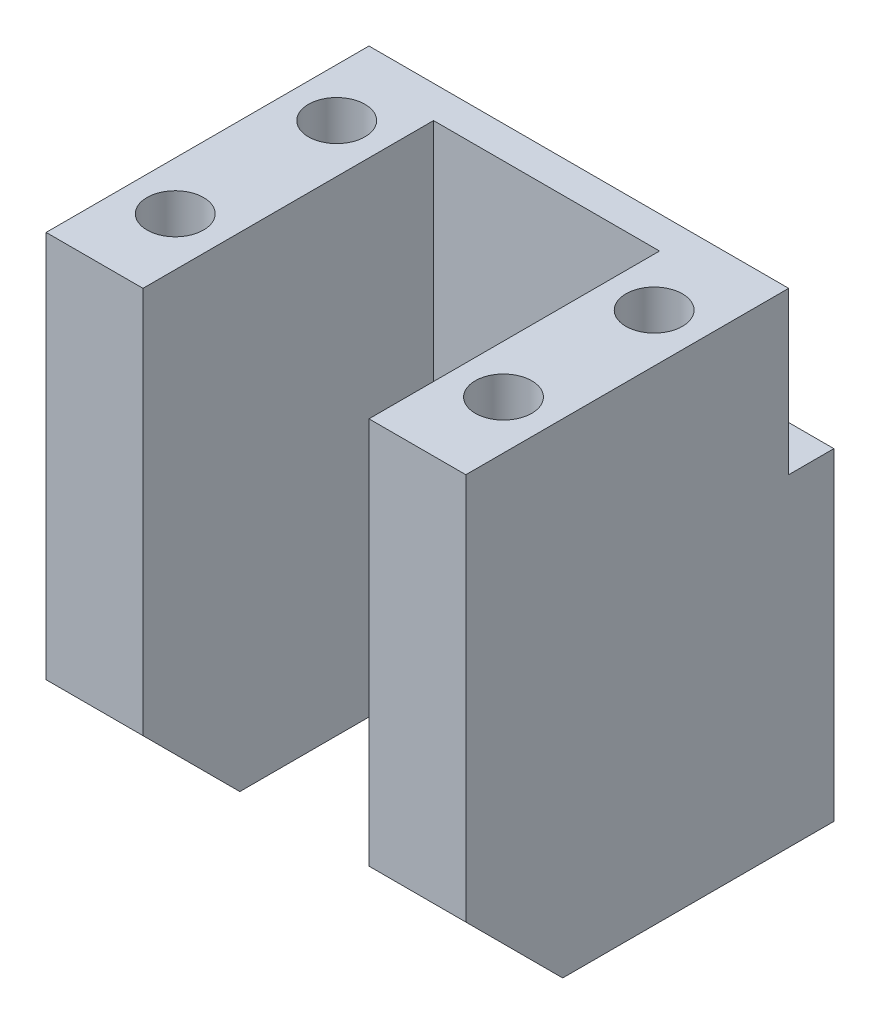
ISO-10303-21;
HEADER;
FILE_DESCRIPTION(('STEP AP214'),'2;1');
FILE_NAME('part.step','',(''),(''),'','','');
FILE_SCHEMA(('AUTOMOTIVE_DESIGN { 1 0 10303 214 1 1 1 1 }'));
ENDSEC;
DATA;
#1=APPLICATION_CONTEXT('core data for automotive mechanical design processes');
#2=APPLICATION_PROTOCOL_DEFINITION('international standard','automotive_design',2000,#1);
#3=PRODUCT_CONTEXT('',#1,'mechanical');
#4=PRODUCT('Part','Part','',(#3));
#5=PRODUCT_RELATED_PRODUCT_CATEGORY('part','',(#4));
#6=PRODUCT_DEFINITION_FORMATION('','',#4);
#7=PRODUCT_DEFINITION_CONTEXT('part definition',#1,'design');
#8=PRODUCT_DEFINITION('design','',#6,#7);
#9=PRODUCT_DEFINITION_SHAPE('','',#8);
#10=(LENGTH_UNIT() NAMED_UNIT(*) SI_UNIT(.MILLI.,.METRE.));
#11=(NAMED_UNIT(*) PLANE_ANGLE_UNIT() SI_UNIT($,.RADIAN.));
#12=(NAMED_UNIT(*) SI_UNIT($,.STERADIAN.) SOLID_ANGLE_UNIT());
#13=UNCERTAINTY_MEASURE_WITH_UNIT(LENGTH_MEASURE(1.E-05),#10,'distance_accuracy_value','');
#14=(GEOMETRIC_REPRESENTATION_CONTEXT(3) GLOBAL_UNCERTAINTY_ASSIGNED_CONTEXT((#13)) GLOBAL_UNIT_ASSIGNED_CONTEXT((#10,
#11,#12)) REPRESENTATION_CONTEXT('',''));
#15=CARTESIAN_POINT('',(0.,0.,0.));
#16=DIRECTION('',(0.,0.,1.));
#17=DIRECTION('',(1.,0.,0.));
#18=AXIS2_PLACEMENT_3D('',#15,#16,#17);
#19=CARTESIAN_POINT('',(26.,20.,-22.8));
#20=DIRECTION('',(0.,-1.,0.));
#21=DIRECTION('',(0.,0.,-1.));
#22=AXIS2_PLACEMENT_3D('',#19,#20,#21);
#23=PLANE('',#22);
#24=DIRECTION('',(0.707106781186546,0.,-0.707106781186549));
#25=VECTOR('',#24,1.);
#26=CARTESIAN_POINT('',(-8.09999999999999,20.,-8.09999999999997));
#27=LINE('',#26,#25);
#28=CARTESIAN_POINT('',(3.8,20.,-20.));
#29=VERTEX_POINT('',#28);
#30=CARTESIAN_POINT('',(5.74644660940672,20.,-21.9464466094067));
#31=VERTEX_POINT('',#30);
#32=EDGE_CURVE('E179',#29,#31,#27,.T.);
#33=ORIENTED_EDGE('',*,*,#32,.T.);
#34=CARTESIAN_POINT('',(5.39289321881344,20.,-22.3));
#35=DIRECTION('',(0.,-1.,0.));
#36=DIRECTION('',(0.,0.,-1.));
#37=AXIS2_PLACEMENT_3D('',#34,#35,#36);
#38=CIRCLE('',#37,0.5);
#39=CARTESIAN_POINT('',(5.39289321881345,20.,-22.8));
#40=VERTEX_POINT('',#39);
#41=EDGE_CURVE('E235',#31,#40,#38,.F.);
#42=ORIENTED_EDGE('',*,*,#41,.T.);
#43=DIRECTION('',(1.,0.,0.));
#44=VECTOR('',#43,1.);
#45=CARTESIAN_POINT('',(26.,20.,-22.8));
#46=LINE('',#45,#44);
#47=CARTESIAN_POINT('',(0.,20.,-22.8));
#48=VERTEX_POINT('',#47);
#49=EDGE_CURVE('E216',#48,#40,#46,.T.);
#50=ORIENTED_EDGE('',*,*,#49,.F.);
#51=DIRECTION('',(0.,0.,1.));
#52=VECTOR('',#51,1.);
#53=CARTESIAN_POINT('',(0.,20.,-22.8));
#54=LINE('',#53,#52);
#55=CARTESIAN_POINT('',(0.,20.,-20.));
#56=VERTEX_POINT('',#55);
#57=EDGE_CURVE('E255',#48,#56,#54,.T.);
#58=ORIENTED_EDGE('',*,*,#57,.T.);
#59=DIRECTION('',(1.,0.,0.));
#60=VECTOR('',#59,1.);
#61=CARTESIAN_POINT('',(26.,20.,-20.));
#62=LINE('',#61,#60);
#63=EDGE_CURVE('E209',#56,#29,#62,.T.);
#64=ORIENTED_EDGE('',*,*,#63,.T.);
#65=EDGE_LOOP('',(#33,#42,#50,#58,#64));
#66=FACE_BOUND('',#65,.T.);
#67=ADVANCED_FACE('F35',(#66),#23,.F.);
#68=CARTESIAN_POINT('',(0.,0.,-22.8));
#69=DIRECTION('',(0.,0.,1.));
#70=DIRECTION('',(1.,0.,0.));
#71=AXIS2_PLACEMENT_3D('',#68,#69,#70);
#72=PLANE('',#71);
#73=ORIENTED_EDGE('',*,*,#49,.T.);
#74=DIRECTION('',(0.,1.,0.));
#75=VECTOR('',#74,1.);
#76=CARTESIAN_POINT('',(5.39289321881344,0.,-22.8));
#77=LINE('',#76,#75);
#78=CARTESIAN_POINT('',(5.39289321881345,0.,-22.8));
#79=VERTEX_POINT('',#78);
#80=EDGE_CURVE('E238',#40,#79,#77,.F.);
#81=ORIENTED_EDGE('',*,*,#80,.T.);
#82=DIRECTION('',(-1.,0.,0.));
#83=VECTOR('',#82,1.);
#84=CARTESIAN_POINT('',(26.,0.,-22.8));
#85=LINE('',#84,#83);
#86=CARTESIAN_POINT('',(0.,0.,-22.8));
#87=VERTEX_POINT('',#86);
#88=EDGE_CURVE('E208',#79,#87,#85,.T.);
#89=ORIENTED_EDGE('',*,*,#88,.T.);
#90=DIRECTION('',(0.,1.,0.));
#91=VECTOR('',#90,1.);
#92=CARTESIAN_POINT('',(0.,0.,-22.8));
#93=LINE('',#92,#91);
#94=EDGE_CURVE('E213',#87,#48,#93,.T.);
#95=ORIENTED_EDGE('',*,*,#94,.T.);
#96=EDGE_LOOP('',(#73,#81,#89,#95));
#97=FACE_BOUND('',#96,.T.);
#98=ADVANCED_FACE('F417',(#97),#72,.F.);
#99=CARTESIAN_POINT('',(0.,30.,0.));
#100=DIRECTION('',(0.,0.,-1.));
#101=DIRECTION('',(-1.,0.,0.));
#102=AXIS2_PLACEMENT_3D('',#99,#100,#101);
#103=PLANE('',#102);
#104=DIRECTION('',(1.,0.,0.));
#105=VECTOR('',#104,1.);
#106=CARTESIAN_POINT('',(0.,6.00000000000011,0.));
#107=LINE('',#106,#105);
#108=CARTESIAN_POINT('',(0.,6.0000000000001,0.));
#109=VERTEX_POINT('',#108);
#110=CARTESIAN_POINT('',(6.,6.00000000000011,0.));
#111=VERTEX_POINT('',#110);
#112=EDGE_CURVE('E287',#109,#111,#107,.T.);
#113=ORIENTED_EDGE('',*,*,#112,.T.);
#114=DIRECTION('',(0.,1.,0.));
#115=VECTOR('',#114,1.);
#116=CARTESIAN_POINT('',(6.,0.,0.));
#117=LINE('',#116,#115);
#118=CARTESIAN_POINT('',(6.,30.,0.));
#119=VERTEX_POINT('',#118);
#120=EDGE_CURVE('E222',#111,#119,#117,.T.);
#121=ORIENTED_EDGE('',*,*,#120,.T.);
#122=DIRECTION('',(1.,0.,0.));
#123=VECTOR('',#122,1.);
#124=CARTESIAN_POINT('',(0.,30.,0.));
#125=LINE('',#124,#123);
#126=CARTESIAN_POINT('',(0.,30.,0.));
#127=VERTEX_POINT('',#126);
#128=EDGE_CURVE('E323',#127,#119,#125,.T.);
#129=ORIENTED_EDGE('',*,*,#128,.F.);
#130=DIRECTION('',(0.,-1.,0.));
#131=VECTOR('',#130,1.);
#132=CARTESIAN_POINT('',(0.,30.,0.));
#133=LINE('',#132,#131);
#134=EDGE_CURVE('E278',#127,#109,#133,.T.);
#135=ORIENTED_EDGE('',*,*,#134,.T.);
#136=EDGE_LOOP('',(#113,#121,#129,#135));
#137=FACE_BOUND('',#136,.T.);
#138=ADVANCED_FACE('F320',(#137),#103,.F.);
#139=CARTESIAN_POINT('',(0.,6.00000000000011,0.));
#140=DIRECTION('',(0.,0.707106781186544,-0.707106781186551));
#141=DIRECTION('',(1.,0.,0.));
#142=AXIS2_PLACEMENT_3D('',#139,#140,#141);
#143=PLANE('',#142);
#144=DIRECTION('',(0.,0.707106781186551,0.707106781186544));
#145=VECTOR('',#144,1.);
#146=CARTESIAN_POINT('',(6.,6.00000000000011,0.));
#147=LINE('',#146,#145);
#148=CARTESIAN_POINT('',(6.,0.,-6.00000000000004));
#149=VERTEX_POINT('',#148);
#150=EDGE_CURVE('E304',#111,#149,#147,.F.);
#151=ORIENTED_EDGE('',*,*,#150,.F.);
#152=ORIENTED_EDGE('',*,*,#112,.F.);
#153=DIRECTION('',(0.,-0.707106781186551,-0.707106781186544));
#154=VECTOR('',#153,1.);
#155=CARTESIAN_POINT('',(0.,18.0000000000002,11.9999999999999));
#156=LINE('',#155,#154);
#157=CARTESIAN_POINT('',(0.,0.,-6.00000000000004));
#158=VERTEX_POINT('',#157);
#159=EDGE_CURVE('E236',#158,#109,#156,.F.);
#160=ORIENTED_EDGE('',*,*,#159,.F.);
#161=DIRECTION('',(-1.,0.,0.));
#162=VECTOR('',#161,1.);
#163=CARTESIAN_POINT('',(0.,0.,-6.00000000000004));
#164=LINE('',#163,#162);
#165=CARTESIAN_POINT('',(1.56385933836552,0.,-6.00000000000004));
#166=VERTEX_POINT('',#165);
#167=EDGE_CURVE('E292',#166,#158,#164,.T.);
#168=ORIENTED_EDGE('',*,*,#167,.F.);
#169=CARTESIAN_POINT('',(3.,1.00000000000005,-5.));
#170=DIRECTION('',(0.,0.707106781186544,-0.707106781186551));
#171=DIRECTION('',(0.,-0.707106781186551,-0.707106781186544));
#172=AXIS2_PLACEMENT_3D('',#169,#170,#171);
#173=ELLIPSE('',#172,2.47487373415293,1.75);
#174=CARTESIAN_POINT('',(4.43614066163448,0.,-6.00000000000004));
#175=VERTEX_POINT('',#174);
#176=EDGE_CURVE('E306',#175,#166,#173,.F.);
#177=ORIENTED_EDGE('',*,*,#176,.F.);
#178=DIRECTION('',(-1.,0.,0.));
#179=VECTOR('',#178,1.);
#180=CARTESIAN_POINT('',(0.,0.,-6.00000000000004));
#181=LINE('',#180,#179);
#182=EDGE_CURVE('E294',#149,#175,#181,.T.);
#183=ORIENTED_EDGE('',*,*,#182,.F.);
#184=EDGE_LOOP('',(#151,#152,#160,#168,#177,#183));
#185=FACE_BOUND('',#184,.T.);
#186=ADVANCED_FACE('F326',(#185),#143,.F.);
#187=CARTESIAN_POINT('',(6.,30.,0.));
#188=DIRECTION('',(-1.,0.,0.));
#189=DIRECTION('',(0.,0.,1.));
#190=AXIS2_PLACEMENT_3D('',#187,#188,#189);
#191=PLANE('',#190);
#192=DIRECTION('',(0.,0.,-1.));
#193=VECTOR('',#192,1.);
#194=CARTESIAN_POINT('',(6.,30.,0.));
#195=LINE('',#194,#193);
#196=CARTESIAN_POINT('',(6.,30.,-18.));
#197=VERTEX_POINT('',#196);
#198=EDGE_CURVE('E335',#119,#197,#195,.T.);
#199=ORIENTED_EDGE('',*,*,#198,.F.);
#200=ORIENTED_EDGE('',*,*,#120,.F.);
#201=ORIENTED_EDGE('',*,*,#150,.T.);
#202=DIRECTION('',(0.,0.,-1.));
#203=VECTOR('',#202,1.);
#204=CARTESIAN_POINT('',(6.,0.,0.));
#205=LINE('',#204,#203);
#206=CARTESIAN_POINT('',(6.,0.,-18.));
#207=VERTEX_POINT('',#206);
#208=EDGE_CURVE('E371',#149,#207,#205,.T.);
#209=ORIENTED_EDGE('',*,*,#208,.T.);
#210=DIRECTION('',(0.,-1.,0.));
#211=VECTOR('',#210,1.);
#212=CARTESIAN_POINT('',(6.,30.,-18.));
#213=LINE('',#212,#211);
#214=EDGE_CURVE('E387',#197,#207,#213,.T.);
#215=ORIENTED_EDGE('',*,*,#214,.F.);
#216=EDGE_LOOP('',(#199,#200,#201,#209,#215));
#217=FACE_BOUND('',#216,.T.);
#218=ADVANCED_FACE('F332',(#217),#191,.F.);
#219=CARTESIAN_POINT('',(0.,30.,-18.));
#220=DIRECTION('',(0.,0.,-1.));
#221=DIRECTION('',(-1.,0.,0.));
#222=AXIS2_PLACEMENT_3D('',#219,#220,#221);
#223=PLANE('',#222);
#224=DIRECTION('',(1.,0.,0.));
#225=VECTOR('',#224,1.);
#226=CARTESIAN_POINT('',(0.,0.,-18.));
#227=LINE('',#226,#225);
#228=CARTESIAN_POINT('',(20.,0.,-18.));
#229=VERTEX_POINT('',#228);
#230=EDGE_CURVE('E373',#207,#229,#227,.T.);
#231=ORIENTED_EDGE('',*,*,#230,.T.);
#232=DIRECTION('',(0.,-1.,0.));
#233=VECTOR('',#232,1.);
#234=CARTESIAN_POINT('',(20.,30.,-18.));
#235=LINE('',#234,#233);
#236=CARTESIAN_POINT('',(20.,30.,-18.));
#237=VERTEX_POINT('',#236);
#238=EDGE_CURVE('E275',#237,#229,#235,.T.);
#239=ORIENTED_EDGE('',*,*,#238,.F.);
#240=DIRECTION('',(1.,0.,0.));
#241=VECTOR('',#240,1.);
#242=CARTESIAN_POINT('',(0.,30.,-18.));
#243=LINE('',#242,#241);
#244=EDGE_CURVE('E356',#197,#237,#243,.T.);
#245=ORIENTED_EDGE('',*,*,#244,.F.);
#246=ORIENTED_EDGE('',*,*,#214,.T.);
#247=EDGE_LOOP('',(#231,#239,#245,#246));
#248=FACE_BOUND('',#247,.T.);
#249=ADVANCED_FACE('F442',(#248),#223,.F.);
#250=CARTESIAN_POINT('',(20.,30.,0.));
#251=DIRECTION('',(-1.,0.,0.));
#252=DIRECTION('',(0.,0.,1.));
#253=AXIS2_PLACEMENT_3D('',#250,#251,#252);
#254=PLANE('',#253);
#255=DIRECTION('',(0.,0.,-1.));
#256=VECTOR('',#255,1.);
#257=CARTESIAN_POINT('',(20.,0.,0.));
#258=LINE('',#257,#256);
#259=CARTESIAN_POINT('',(20.,0.,-6.00000000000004));
#260=VERTEX_POINT('',#259);
#261=EDGE_CURVE('E376',#260,#229,#258,.T.);
#262=ORIENTED_EDGE('',*,*,#261,.F.);
#263=DIRECTION('',(0.,-0.707106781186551,-0.707106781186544));
#264=VECTOR('',#263,1.);
#265=CARTESIAN_POINT('',(20.,18.0000000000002,11.9999999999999));
#266=LINE('',#265,#264);
#267=CARTESIAN_POINT('',(20.,6.00000000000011,0.));
#268=VERTEX_POINT('',#267);
#269=EDGE_CURVE('E302',#260,#268,#266,.F.);
#270=ORIENTED_EDGE('',*,*,#269,.T.);
#271=DIRECTION('',(0.,-1.,0.));
#272=VECTOR('',#271,1.);
#273=CARTESIAN_POINT('',(20.,0.,0.));
#274=LINE('',#273,#272);
#275=CARTESIAN_POINT('',(20.,30.,0.));
#276=VERTEX_POINT('',#275);
#277=EDGE_CURVE('E336',#276,#268,#274,.T.);
#278=ORIENTED_EDGE('',*,*,#277,.F.);
#279=DIRECTION('',(0.,0.,-1.));
#280=VECTOR('',#279,1.);
#281=CARTESIAN_POINT('',(20.,30.,0.));
#282=LINE('',#281,#280);
#283=EDGE_CURVE('E358',#276,#237,#282,.T.);
#284=ORIENTED_EDGE('',*,*,#283,.T.);
#285=ORIENTED_EDGE('',*,*,#238,.T.);
#286=EDGE_LOOP('',(#262,#270,#278,#284,#285));
#287=FACE_BOUND('',#286,.T.);
#288=ADVANCED_FACE('F450',(#287),#254,.T.);
#289=CARTESIAN_POINT('',(26.,30.,0.));
#290=VERTEX_POINT('',#289);
#291=EDGE_CURVE('E463',#276,#290,#125,.T.);
#292=ORIENTED_EDGE('',*,*,#291,.F.);
#293=ORIENTED_EDGE('',*,*,#277,.T.);
#294=CARTESIAN_POINT('',(26.,6.0000000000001,0.));
#295=VERTEX_POINT('',#294);
#296=EDGE_CURVE('E290',#268,#295,#107,.T.);
#297=ORIENTED_EDGE('',*,*,#296,.T.);
#298=DIRECTION('',(0.,-1.,0.));
#299=VECTOR('',#298,1.);
#300=CARTESIAN_POINT('',(26.,30.,0.));
#301=LINE('',#300,#299);
#302=EDGE_CURVE('E273',#290,#295,#301,.T.);
#303=ORIENTED_EDGE('',*,*,#302,.F.);
#304=EDGE_LOOP('',(#292,#293,#297,#303));
#305=FACE_BOUND('',#304,.T.);
#306=ADVANCED_FACE('F394',(#305),#103,.F.);
#307=CARTESIAN_POINT('',(26.,30.,0.));
#308=DIRECTION('',(-1.,0.,0.));
#309=DIRECTION('',(0.,0.,1.));
#310=AXIS2_PLACEMENT_3D('',#307,#308,#309);
#311=PLANE('',#310);
#312=ORIENTED_EDGE('',*,*,#302,.T.);
#313=DIRECTION('',(0.,0.707106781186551,0.707106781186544));
#314=VECTOR('',#313,1.);
#315=CARTESIAN_POINT('',(26.,6.00000000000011,0.));
#316=LINE('',#315,#314);
#317=CARTESIAN_POINT('',(26.,0.,-6.00000000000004));
#318=VERTEX_POINT('',#317);
#319=EDGE_CURVE('E261',#295,#318,#316,.F.);
#320=ORIENTED_EDGE('',*,*,#319,.T.);
#321=DIRECTION('',(0.,0.,-1.));
#322=VECTOR('',#321,1.);
#323=CARTESIAN_POINT('',(26.,0.,0.));
#324=LINE('',#323,#322);
#325=CARTESIAN_POINT('',(26.,0.,-22.8));
#326=VERTEX_POINT('',#325);
#327=EDGE_CURVE('E259',#318,#326,#324,.T.);
#328=ORIENTED_EDGE('',*,*,#327,.T.);
#329=DIRECTION('',(0.,-1.,0.));
#330=VECTOR('',#329,1.);
#331=CARTESIAN_POINT('',(26.,0.,-22.8));
#332=LINE('',#331,#330);
#333=CARTESIAN_POINT('',(26.,20.,-22.8));
#334=VERTEX_POINT('',#333);
#335=EDGE_CURVE('E205',#334,#326,#332,.T.);
#336=ORIENTED_EDGE('',*,*,#335,.F.);
#337=DIRECTION('',(0.,0.,1.));
#338=VECTOR('',#337,1.);
#339=CARTESIAN_POINT('',(26.,20.,-22.8));
#340=LINE('',#339,#338);
#341=CARTESIAN_POINT('',(26.,20.,-20.));
#342=VERTEX_POINT('',#341);
#343=EDGE_CURVE('E219',#334,#342,#340,.T.);
#344=ORIENTED_EDGE('',*,*,#343,.T.);
#345=DIRECTION('',(0.,-1.,0.));
#346=VECTOR('',#345,1.);
#347=CARTESIAN_POINT('',(26.,30.,-20.));
#348=LINE('',#347,#346);
#349=CARTESIAN_POINT('',(26.,30.,-20.));
#350=VERTEX_POINT('',#349);
#351=EDGE_CURVE('E269',#350,#342,#348,.T.);
#352=ORIENTED_EDGE('',*,*,#351,.F.);
#353=DIRECTION('',(0.,0.,-1.));
#354=VECTOR('',#353,1.);
#355=CARTESIAN_POINT('',(26.,30.,0.));
#356=LINE('',#355,#354);
#357=EDGE_CURVE('E349',#290,#350,#356,.T.);
#358=ORIENTED_EDGE('',*,*,#357,.F.);
#359=EDGE_LOOP('',(#312,#320,#328,#336,#344,#352,#358));
#360=FACE_BOUND('',#359,.T.);
#361=ADVANCED_FACE('F257',(#360),#311,.F.);
#362=CARTESIAN_POINT('',(0.,30.,-20.));
#363=DIRECTION('',(0.,0.,-1.));
#364=DIRECTION('',(-1.,0.,0.));
#365=AXIS2_PLACEMENT_3D('',#362,#363,#364);
#366=PLANE('',#365);
#367=ORIENTED_EDGE('',*,*,#63,.F.);
#368=DIRECTION('',(0.,-1.,0.));
#369=VECTOR('',#368,1.);
#370=CARTESIAN_POINT('',(0.,30.,-20.));
#371=LINE('',#370,#369);
#372=CARTESIAN_POINT('',(0.,30.,-20.));
#373=VERTEX_POINT('',#372);
#374=EDGE_CURVE('E274',#373,#56,#371,.T.);
#375=ORIENTED_EDGE('',*,*,#374,.F.);
#376=DIRECTION('',(1.,0.,0.));
#377=VECTOR('',#376,1.);
#378=CARTESIAN_POINT('',(0.,30.,-20.));
#379=LINE('',#378,#377);
#380=EDGE_CURVE('E271',#373,#350,#379,.T.);
#381=ORIENTED_EDGE('',*,*,#380,.T.);
#382=ORIENTED_EDGE('',*,*,#351,.T.);
#383=CARTESIAN_POINT('',(22.2,20.,-20.));
#384=VERTEX_POINT('',#383);
#385=EDGE_CURVE('E203',#384,#342,#62,.T.);
#386=ORIENTED_EDGE('',*,*,#385,.F.);
#387=DIRECTION('',(0.,1.,0.));
#388=VECTOR('',#387,1.);
#389=CARTESIAN_POINT('',(22.2,0.,-20.));
#390=LINE('',#389,#388);
#391=CARTESIAN_POINT('',(22.2,0.,-20.));
#392=VERTEX_POINT('',#391);
#393=EDGE_CURVE('E182',#392,#384,#390,.T.);
#394=ORIENTED_EDGE('',*,*,#393,.F.);
#395=DIRECTION('',(1.,0.,0.));
#396=VECTOR('',#395,1.);
#397=CARTESIAN_POINT('',(0.,0.,-20.));
#398=LINE('',#397,#396);
#399=CARTESIAN_POINT('',(3.8,0.,-20.));
#400=VERTEX_POINT('',#399);
#401=EDGE_CURVE('E186',#400,#392,#398,.T.);
#402=ORIENTED_EDGE('',*,*,#401,.F.);
#403=DIRECTION('',(0.,1.,0.));
#404=VECTOR('',#403,1.);
#405=CARTESIAN_POINT('',(3.8,0.,-20.));
#406=LINE('',#405,#404);
#407=EDGE_CURVE('E171',#400,#29,#406,.T.);
#408=ORIENTED_EDGE('',*,*,#407,.T.);
#409=EDGE_LOOP('',(#367,#375,#381,#382,#386,#394,#402,#408));
#410=FACE_BOUND('',#409,.T.);
#411=ADVANCED_FACE('F187',(#410),#366,.T.);
#412=CARTESIAN_POINT('',(23.,30.,-5.33441582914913));
#413=DIRECTION('',(0.,-1.,0.));
#414=DIRECTION('',(0.,0.,-1.));
#415=AXIS2_PLACEMENT_3D('',#412,#413,#414);
#416=CYLINDRICAL_SURFACE('',#415,1.75);
#417=CARTESIAN_POINT('',(23.,30.,-5.33441582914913));
#418=DIRECTION('',(0.,1.,0.));
#419=DIRECTION('',(0.,0.,1.));
#420=AXIS2_PLACEMENT_3D('',#417,#418,#419);
#421=CIRCLE('',#420,1.75);
#422=CARTESIAN_POINT('',(23.,30.,-3.58441582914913));
#423=VERTEX_POINT('',#422);
#424=EDGE_CURVE('E361',#423,#423,#421,.T.);
#425=ORIENTED_EDGE('',*,*,#424,.T.);
#426=EDGE_LOOP('',(#425));
#427=FACE_BOUND('',#426,.T.);
#428=CARTESIAN_POINT('',(23.,0.,-5.33441582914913));
#429=DIRECTION('',(0.,1.,0.));
#430=DIRECTION('',(0.,0.,1.));
#431=AXIS2_PLACEMENT_3D('',#428,#429,#430);
#432=CIRCLE('',#431,1.75);
#433=CARTESIAN_POINT('',(24.6184862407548,0.,-6.00000000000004));
#434=VERTEX_POINT('',#433);
#435=CARTESIAN_POINT('',(21.3815137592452,0.,-6.00000000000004));
#436=VERTEX_POINT('',#435);
#437=EDGE_CURVE('E378',#434,#436,#432,.T.);
#438=ORIENTED_EDGE('',*,*,#437,.F.);
#439=CARTESIAN_POINT('',(23.,0.665584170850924,-5.33441582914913));
#440=DIRECTION('',(0.,0.707106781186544,-0.707106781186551));
#441=DIRECTION('',(0.,-0.707106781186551,-0.707106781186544));
#442=AXIS2_PLACEMENT_3D('',#439,#440,#441);
#443=ELLIPSE('',#442,2.47487373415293,1.75);
#444=EDGE_CURVE('E300',#434,#436,#443,.F.);
#445=ORIENTED_EDGE('',*,*,#444,.T.);
#446=EDGE_LOOP('',(#438,#445));
#447=FACE_BOUND('',#446,.T.);
#448=ADVANCED_FACE('F403',(#427,#447),#416,.F.);
#449=CARTESIAN_POINT('',(0.,30.,0.));
#450=DIRECTION('',(-1.,0.,0.));
#451=DIRECTION('',(0.,0.,1.));
#452=AXIS2_PLACEMENT_3D('',#449,#450,#451);
#453=PLANE('',#452);
#454=DIRECTION('',(0.,0.,-1.));
#455=VECTOR('',#454,1.);
#456=CARTESIAN_POINT('',(0.,0.,0.));
#457=LINE('',#456,#455);
#458=EDGE_CURVE('E263',#158,#87,#457,.T.);
#459=ORIENTED_EDGE('',*,*,#458,.F.);
#460=ORIENTED_EDGE('',*,*,#159,.T.);
#461=ORIENTED_EDGE('',*,*,#134,.F.);
#462=DIRECTION('',(0.,0.,-1.));
#463=VECTOR('',#462,1.);
#464=CARTESIAN_POINT('',(0.,30.,0.));
#465=LINE('',#464,#463);
#466=EDGE_CURVE('E345',#127,#373,#465,.T.);
#467=ORIENTED_EDGE('',*,*,#466,.T.);
#468=ORIENTED_EDGE('',*,*,#374,.T.);
#469=ORIENTED_EDGE('',*,*,#57,.F.);
#470=ORIENTED_EDGE('',*,*,#94,.F.);
#471=EDGE_LOOP('',(#459,#460,#461,#467,#468,#469,#470));
#472=FACE_BOUND('',#471,.T.);
#473=ADVANCED_FACE('F311',(#472),#453,.T.);
#474=CARTESIAN_POINT('',(3.,30.,-15.));
#475=DIRECTION('',(0.,-1.,0.));
#476=DIRECTION('',(0.,0.,-1.));
#477=AXIS2_PLACEMENT_3D('',#474,#475,#476);
#478=CYLINDRICAL_SURFACE('',#477,1.75);
#479=CARTESIAN_POINT('',(3.,30.,-15.));
#480=DIRECTION('',(0.,1.,0.));
#481=DIRECTION('',(0.,0.,1.));
#482=AXIS2_PLACEMENT_3D('',#479,#480,#481);
#483=CIRCLE('',#482,1.75);
#484=CARTESIAN_POINT('',(3.,30.,-13.25));
#485=VERTEX_POINT('',#484);
#486=EDGE_CURVE('E464',#485,#485,#483,.T.);
#487=ORIENTED_EDGE('',*,*,#486,.T.);
#488=EDGE_LOOP('',(#487));
#489=FACE_BOUND('',#488,.T.);
#490=CARTESIAN_POINT('',(3.,0.,-15.));
#491=DIRECTION('',(0.,1.,0.));
#492=DIRECTION('',(0.,0.,1.));
#493=AXIS2_PLACEMENT_3D('',#490,#491,#492);
#494=CIRCLE('',#493,1.75);
#495=CARTESIAN_POINT('',(3.,0.,-13.25));
#496=VERTEX_POINT('',#495);
#497=EDGE_CURVE('E264',#496,#496,#494,.T.);
#498=ORIENTED_EDGE('',*,*,#497,.F.);
#499=EDGE_LOOP('',(#498));
#500=FACE_BOUND('',#499,.T.);
#501=ADVANCED_FACE('F411',(#489,#500),#478,.F.);
#502=CARTESIAN_POINT('',(23.,30.,-14.6655841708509));
#503=DIRECTION('',(0.,-1.,0.));
#504=DIRECTION('',(0.,0.,-1.));
#505=AXIS2_PLACEMENT_3D('',#502,#503,#504);
#506=CYLINDRICAL_SURFACE('',#505,1.75);
#507=CARTESIAN_POINT('',(23.,30.,-14.6655841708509));
#508=DIRECTION('',(0.,1.,0.));
#509=DIRECTION('',(0.,0.,1.));
#510=AXIS2_PLACEMENT_3D('',#507,#508,#509);
#511=CIRCLE('',#510,1.75);
#512=CARTESIAN_POINT('',(23.,30.,-12.9155841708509));
#513=VERTEX_POINT('',#512);
#514=EDGE_CURVE('E384',#513,#513,#511,.F.);
#515=ORIENTED_EDGE('',*,*,#514,.F.);
#516=EDGE_LOOP('',(#515));
#517=FACE_BOUND('',#516,.T.);
#518=CARTESIAN_POINT('',(23.,0.,-14.6655841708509));
#519=DIRECTION('',(0.,1.,0.));
#520=DIRECTION('',(0.,0.,1.));
#521=AXIS2_PLACEMENT_3D('',#518,#519,#520);
#522=CIRCLE('',#521,1.75);
#523=CARTESIAN_POINT('',(23.,0.,-12.9155841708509));
#524=VERTEX_POINT('',#523);
#525=EDGE_CURVE('E338',#524,#524,#522,.F.);
#526=ORIENTED_EDGE('',*,*,#525,.T.);
#527=EDGE_LOOP('',(#526));
#528=FACE_BOUND('',#527,.T.);
#529=ADVANCED_FACE('F472',(#517,#528),#506,.F.);
#530=CARTESIAN_POINT('',(3.,30.,-5.));
#531=DIRECTION('',(0.,-1.,0.));
#532=DIRECTION('',(0.,0.,-1.));
#533=AXIS2_PLACEMENT_3D('',#530,#531,#532);
#534=CYLINDRICAL_SURFACE('',#533,1.75);
#535=CARTESIAN_POINT('',(3.,30.,-5.));
#536=DIRECTION('',(0.,1.,0.));
#537=DIRECTION('',(0.,0.,1.));
#538=AXIS2_PLACEMENT_3D('',#535,#536,#537);
#539=CIRCLE('',#538,1.75);
#540=CARTESIAN_POINT('',(3.,30.,-3.25));
#541=VERTEX_POINT('',#540);
#542=EDGE_CURVE('E325',#541,#541,#539,.F.);
#543=ORIENTED_EDGE('',*,*,#542,.F.);
#544=EDGE_LOOP('',(#543));
#545=FACE_BOUND('',#544,.T.);
#546=CARTESIAN_POINT('',(3.,0.,-5.));
#547=DIRECTION('',(0.,1.,0.));
#548=DIRECTION('',(0.,0.,1.));
#549=AXIS2_PLACEMENT_3D('',#546,#547,#548);
#550=CIRCLE('',#549,1.75);
#551=EDGE_CURVE('E381',#166,#175,#550,.F.);
#552=ORIENTED_EDGE('',*,*,#551,.T.);
#553=ORIENTED_EDGE('',*,*,#176,.T.);
#554=EDGE_LOOP('',(#552,#553));
#555=FACE_BOUND('',#554,.T.);
#556=ADVANCED_FACE('F475',(#545,#555),#534,.F.);
#557=CARTESIAN_POINT('',(0.,30.,0.));
#558=DIRECTION('',(0.,1.,0.));
#559=DIRECTION('',(0.,0.,1.));
#560=AXIS2_PLACEMENT_3D('',#557,#558,#559);
#561=PLANE('',#560);
#562=ORIENTED_EDGE('',*,*,#128,.T.);
#563=ORIENTED_EDGE('',*,*,#198,.T.);
#564=ORIENTED_EDGE('',*,*,#244,.T.);
#565=ORIENTED_EDGE('',*,*,#283,.F.);
#566=ORIENTED_EDGE('',*,*,#291,.T.);
#567=ORIENTED_EDGE('',*,*,#357,.T.);
#568=ORIENTED_EDGE('',*,*,#380,.F.);
#569=ORIENTED_EDGE('',*,*,#466,.F.);
#570=EDGE_LOOP('',(#562,#563,#564,#565,#566,#567,#568,#569));
#571=FACE_BOUND('',#570,.T.);
#572=ORIENTED_EDGE('',*,*,#514,.T.);
#573=EDGE_LOOP('',(#572));
#574=FACE_BOUND('',#573,.T.);
#575=ORIENTED_EDGE('',*,*,#486,.F.);
#576=EDGE_LOOP('',(#575));
#577=FACE_BOUND('',#576,.T.);
#578=ORIENTED_EDGE('',*,*,#424,.F.);
#579=EDGE_LOOP('',(#578));
#580=FACE_BOUND('',#579,.T.);
#581=ORIENTED_EDGE('',*,*,#542,.T.);
#582=EDGE_LOOP('',(#581));
#583=FACE_BOUND('',#582,.T.);
#584=ADVANCED_FACE('F347',(#571,#574,#577,#580,#583),#561,.T.);
#585=CARTESIAN_POINT('',(0.,0.,0.));
#586=DIRECTION('',(0.,1.,0.));
#587=DIRECTION('',(0.,0.,1.));
#588=AXIS2_PLACEMENT_3D('',#585,#586,#587);
#589=PLANE('',#588);
#590=ORIENTED_EDGE('',*,*,#525,.F.);
#591=EDGE_LOOP('',(#590));
#592=FACE_BOUND('',#591,.T.);
#593=ORIENTED_EDGE('',*,*,#497,.T.);
#594=EDGE_LOOP('',(#593));
#595=FACE_BOUND('',#594,.T.);
#596=ORIENTED_EDGE('',*,*,#88,.F.);
#597=CARTESIAN_POINT('',(5.39289321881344,0.,-22.3));
#598=DIRECTION('',(0.,1.,0.));
#599=DIRECTION('',(0.,0.,1.));
#600=AXIS2_PLACEMENT_3D('',#597,#598,#599);
#601=CIRCLE('',#600,0.5);
#602=CARTESIAN_POINT('',(5.74644660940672,0.,-21.9464466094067));
#603=VERTEX_POINT('',#602);
#604=EDGE_CURVE('E196',#79,#603,#601,.F.);
#605=ORIENTED_EDGE('',*,*,#604,.T.);
#606=DIRECTION('',(0.707106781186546,0.,-0.707106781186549));
#607=VECTOR('',#606,1.);
#608=CARTESIAN_POINT('',(-8.09999999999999,0.,-8.09999999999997));
#609=LINE('',#608,#607);
#610=EDGE_CURVE('E176',#400,#603,#609,.T.);
#611=ORIENTED_EDGE('',*,*,#610,.F.);
#612=ORIENTED_EDGE('',*,*,#401,.T.);
#613=DIRECTION('',(-0.707106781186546,0.,-0.707106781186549));
#614=VECTOR('',#613,1.);
#615=CARTESIAN_POINT('',(21.1,0.,-21.1));
#616=LINE('',#615,#614);
#617=CARTESIAN_POINT('',(20.2535533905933,0.,-21.9464466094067));
#618=VERTEX_POINT('',#617);
#619=EDGE_CURVE('E183',#392,#618,#616,.T.);
#620=ORIENTED_EDGE('',*,*,#619,.T.);
#621=CARTESIAN_POINT('',(20.6071067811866,0.,-22.3));
#622=DIRECTION('',(0.,1.,0.));
#623=DIRECTION('',(0.,0.,1.));
#624=AXIS2_PLACEMENT_3D('',#621,#622,#623);
#625=CIRCLE('',#624,0.5);
#626=CARTESIAN_POINT('',(20.6071067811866,0.,-22.8));
#627=VERTEX_POINT('',#626);
#628=EDGE_CURVE('E240',#618,#627,#625,.F.);
#629=ORIENTED_EDGE('',*,*,#628,.T.);
#630=EDGE_CURVE('E210',#326,#627,#85,.T.);
#631=ORIENTED_EDGE('',*,*,#630,.F.);
#632=ORIENTED_EDGE('',*,*,#327,.F.);
#633=DIRECTION('',(-1.,0.,0.));
#634=VECTOR('',#633,1.);
#635=CARTESIAN_POINT('',(0.,0.,-6.00000000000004));
#636=LINE('',#635,#634);
#637=EDGE_CURVE('E298',#318,#434,#636,.T.);
#638=ORIENTED_EDGE('',*,*,#637,.T.);
#639=ORIENTED_EDGE('',*,*,#437,.T.);
#640=DIRECTION('',(-1.,0.,0.));
#641=VECTOR('',#640,1.);
#642=CARTESIAN_POINT('',(0.,0.,-6.00000000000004));
#643=LINE('',#642,#641);
#644=EDGE_CURVE('E296',#436,#260,#643,.T.);
#645=ORIENTED_EDGE('',*,*,#644,.T.);
#646=ORIENTED_EDGE('',*,*,#261,.T.);
#647=ORIENTED_EDGE('',*,*,#230,.F.);
#648=ORIENTED_EDGE('',*,*,#208,.F.);
#649=ORIENTED_EDGE('',*,*,#182,.T.);
#650=ORIENTED_EDGE('',*,*,#551,.F.);
#651=ORIENTED_EDGE('',*,*,#167,.T.);
#652=ORIENTED_EDGE('',*,*,#458,.T.);
#653=EDGE_LOOP('',(#596,#605,#611,#612,#620,#629,#631,#632,#638,#639,#645,#646,#647,#648,#649,
#650,#651,#652));
#654=FACE_BOUND('',#653,.T.);
#655=ADVANCED_FACE('F194',(#592,#595,#654),#589,.F.);
#656=ORIENTED_EDGE('',*,*,#296,.F.);
#657=ORIENTED_EDGE('',*,*,#269,.F.);
#658=ORIENTED_EDGE('',*,*,#644,.F.);
#659=ORIENTED_EDGE('',*,*,#444,.F.);
#660=ORIENTED_EDGE('',*,*,#637,.F.);
#661=ORIENTED_EDGE('',*,*,#319,.F.);
#662=EDGE_LOOP('',(#656,#657,#658,#659,#660,#661));
#663=FACE_BOUND('',#662,.T.);
#664=ADVANCED_FACE('F398',(#663),#143,.F.);
#665=CARTESIAN_POINT('',(20.6071067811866,20.,-22.8));
#666=VERTEX_POINT('',#665);
#667=EDGE_CURVE('E215',#666,#334,#46,.T.);
#668=ORIENTED_EDGE('',*,*,#667,.F.);
#669=CARTESIAN_POINT('',(20.6071067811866,20.,-22.3));
#670=DIRECTION('',(0.,-1.,0.));
#671=DIRECTION('',(0.,0.,-1.));
#672=AXIS2_PLACEMENT_3D('',#669,#670,#671);
#673=CIRCLE('',#672,0.5);
#674=CARTESIAN_POINT('',(20.2535533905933,20.,-21.9464466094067));
#675=VERTEX_POINT('',#674);
#676=EDGE_CURVE('E43',#666,#675,#673,.F.);
#677=ORIENTED_EDGE('',*,*,#676,.T.);
#678=DIRECTION('',(-0.707106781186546,0.,-0.707106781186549));
#679=VECTOR('',#678,1.);
#680=CARTESIAN_POINT('',(21.1,20.,-21.1));
#681=LINE('',#680,#679);
#682=EDGE_CURVE('E197',#384,#675,#681,.T.);
#683=ORIENTED_EDGE('',*,*,#682,.F.);
#684=ORIENTED_EDGE('',*,*,#385,.T.);
#685=ORIENTED_EDGE('',*,*,#343,.F.);
#686=EDGE_LOOP('',(#668,#677,#683,#684,#685));
#687=FACE_BOUND('',#686,.T.);
#688=ADVANCED_FACE('F249',(#687),#23,.F.);
#689=ORIENTED_EDGE('',*,*,#630,.T.);
#690=DIRECTION('',(0.,1.,0.));
#691=VECTOR('',#690,1.);
#692=CARTESIAN_POINT('',(20.6071067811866,0.,-22.8));
#693=LINE('',#692,#691);
#694=EDGE_CURVE('E243',#627,#666,#693,.T.);
#695=ORIENTED_EDGE('',*,*,#694,.T.);
#696=ORIENTED_EDGE('',*,*,#667,.T.);
#697=ORIENTED_EDGE('',*,*,#335,.T.);
#698=EDGE_LOOP('',(#689,#695,#696,#697));
#699=FACE_BOUND('',#698,.T.);
#700=ADVANCED_FACE('F245',(#699),#72,.F.);
#701=CARTESIAN_POINT('',(21.1,0.,-21.1));
#702=DIRECTION('',(0.707106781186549,0.,-0.707106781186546));
#703=DIRECTION('',(-0.707106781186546,0.,-0.707106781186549));
#704=AXIS2_PLACEMENT_3D('',#701,#702,#703);
#705=PLANE('',#704);
#706=ORIENTED_EDGE('',*,*,#682,.T.);
#707=DIRECTION('',(0.,1.,0.));
#708=VECTOR('',#707,1.);
#709=CARTESIAN_POINT('',(20.2535533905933,0.,-21.9464466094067));
#710=LINE('',#709,#708);
#711=EDGE_CURVE('E11',#675,#618,#710,.F.);
#712=ORIENTED_EDGE('',*,*,#711,.T.);
#713=ORIENTED_EDGE('',*,*,#619,.F.);
#714=ORIENTED_EDGE('',*,*,#393,.T.);
#715=EDGE_LOOP('',(#706,#712,#713,#714));
#716=FACE_BOUND('',#715,.T.);
#717=ADVANCED_FACE('F267',(#716),#705,.F.);
#718=CARTESIAN_POINT('',(-8.09999999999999,0.,-8.09999999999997));
#719=DIRECTION('',(0.707106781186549,0.,0.707106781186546));
#720=DIRECTION('',(0.707106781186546,0.,-0.707106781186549));
#721=AXIS2_PLACEMENT_3D('',#718,#719,#720);
#722=PLANE('',#721);
#723=ORIENTED_EDGE('',*,*,#610,.T.);
#724=DIRECTION('',(0.,1.,0.));
#725=VECTOR('',#724,1.);
#726=CARTESIAN_POINT('',(5.74644660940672,20.,-21.9464466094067));
#727=LINE('',#726,#725);
#728=EDGE_CURVE('E233',#603,#31,#727,.T.);
#729=ORIENTED_EDGE('',*,*,#728,.T.);
#730=ORIENTED_EDGE('',*,*,#32,.F.);
#731=ORIENTED_EDGE('',*,*,#407,.F.);
#732=EDGE_LOOP('',(#723,#729,#730,#731));
#733=FACE_BOUND('',#732,.T.);
#734=ADVANCED_FACE('F173',(#733),#722,.T.);
#735=CARTESIAN_POINT('',(5.39289321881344,0.,-22.3));
#736=DIRECTION('',(0.,-1.,0.));
#737=DIRECTION('',(0.,0.,-1.));
#738=AXIS2_PLACEMENT_3D('',#735,#736,#737);
#739=CYLINDRICAL_SURFACE('',#738,0.5);
#740=ORIENTED_EDGE('',*,*,#604,.F.);
#741=ORIENTED_EDGE('',*,*,#80,.F.);
#742=ORIENTED_EDGE('',*,*,#41,.F.);
#743=ORIENTED_EDGE('',*,*,#728,.F.);
#744=EDGE_LOOP('',(#740,#741,#742,#743));
#745=FACE_BOUND('',#744,.T.);
#746=ADVANCED_FACE('F496',(#745),#739,.T.);
#747=CARTESIAN_POINT('',(20.6071067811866,0.,-22.3));
#748=DIRECTION('',(0.,1.,0.));
#749=DIRECTION('',(0.,0.,1.));
#750=AXIS2_PLACEMENT_3D('',#747,#748,#749);
#751=CYLINDRICAL_SURFACE('',#750,0.5);
#752=ORIENTED_EDGE('',*,*,#628,.F.);
#753=ORIENTED_EDGE('',*,*,#711,.F.);
#754=ORIENTED_EDGE('',*,*,#676,.F.);
#755=ORIENTED_EDGE('',*,*,#694,.F.);
#756=EDGE_LOOP('',(#752,#753,#754,#755));
#757=FACE_BOUND('',#756,.T.);
#758=ADVANCED_FACE('F37',(#757),#751,.T.);
#759=CLOSED_SHELL('',(#67,#98,#138,#186,#218,#249,#288,#306,#361,#411,#448,#473,#501,#529,#556,
#584,#655,#664,#688,#700,#717,#734,#746,#758));
#760=MANIFOLD_SOLID_BREP('B2',#759);
#761=ADVANCED_BREP_SHAPE_REPRESENTATION('',(#18,#760),#14);
#762=SHAPE_DEFINITION_REPRESENTATION(#9,#761);
ENDSEC;
END-ISO-10303-21;
